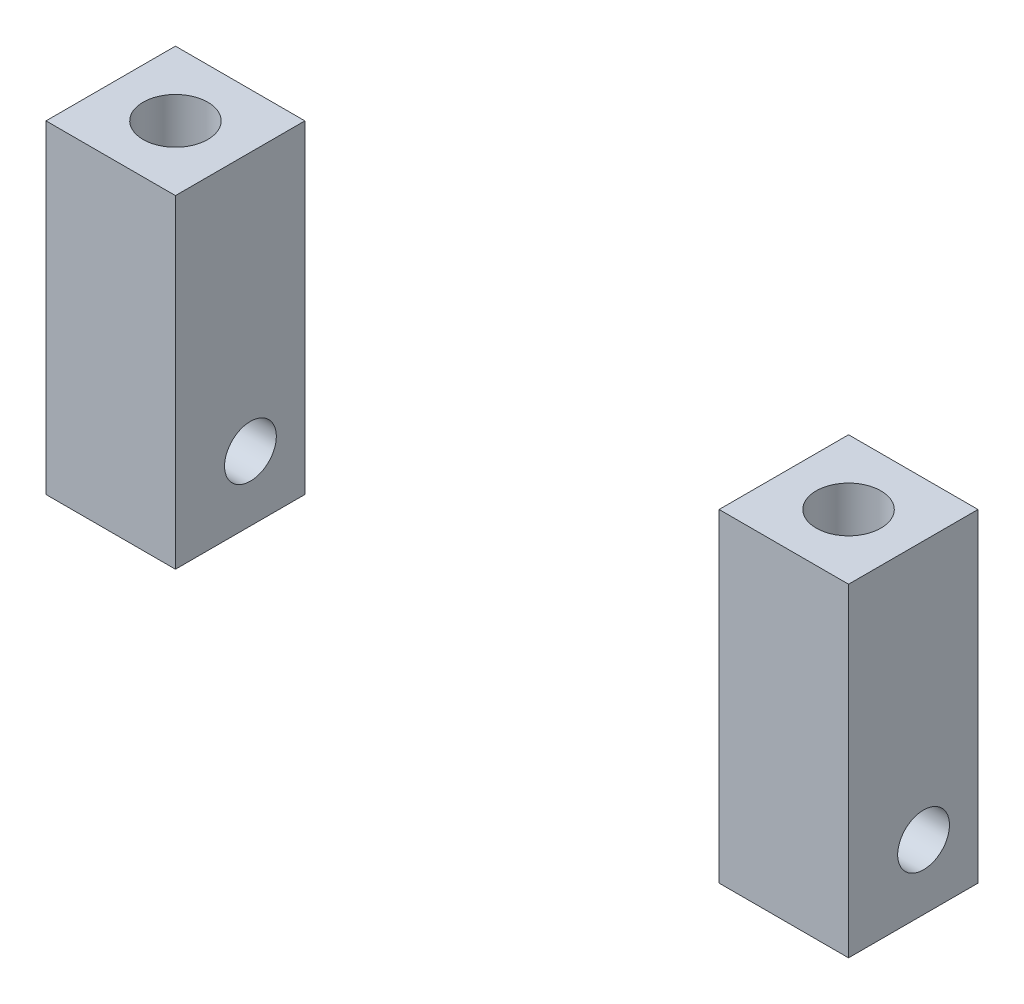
from build123d import *

# Parameters (mm, degrees)
SKIZZE1_W                         = 10
SKIZZE1_H                         = 10
AUFSATZ_LINEAR_AUSTRAGEN1_DEPTH   = 25
AUFSATZ_LINEAR_AUSTRAGEN1_2_DEPTH = 25
SKIZZE2_R                         = 2.5
SCHNITT_LINEAR_AUSTRAGEN1_DEPTH   = 15
SKIZZE3_R                         = 2
SCHNITT_LINEAR_AUSTRAGEN3_DEPTH   = 62


with BuildPart() as part:
    # Skizze1 → Aufsatz-Linear austragen1 (new body)
    with BuildSketch(Plane(origin=(0, 0, 0), x_dir=(1, 0, 0), z_dir=(0, 1, 0))):
        with Locations((8.805033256, -0.794554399)):
            Rectangle(SKIZZE1_W, SKIZZE1_H)
    extrude(amount=AUFSATZ_LINEAR_AUSTRAGEN1_DEPTH)


with BuildPart() as body_2:
    # Skizze1 → Aufsatz-Linear austragen1 2 (new body)
    with BuildSketch(Plane(origin=(0, 0, 0), x_dir=(1, 0, 0), z_dir=(0, 1, 0))):
        with Locations((-43.194966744, -0.794554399)):
            Rectangle(SKIZZE1_W, SKIZZE1_H)
    extrude(amount=AUFSATZ_LINEAR_AUSTRAGEN1_2_DEPTH)


with BuildPart() as schnitt_linear_austragen1_tool:
    # Skizze2 → Schnitt-Linear austragen1 (new body)
    with BuildSketch(Plane(origin=(0, 25, 0), x_dir=(1, 0, 0), z_dir=(0, 1, 0))):
        with Locations(Location((8.805033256, -0.794554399, 0), (0, 0, 270))):
            Circle(SKIZZE2_R)
        with Locations(Location((-43.194966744, -0.794554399, 0), (0, 0, 270))):
            Circle(SKIZZE2_R)
    extrude(amount=-SCHNITT_LINEAR_AUSTRAGEN1_DEPTH)


with BuildPart() as part_1:
    add(part.part)

    # Schnitt-Linear austragen1: cut by schnitt_linear_austragen1_tool
    add(schnitt_linear_austragen1_tool.part, mode=Mode.SUBTRACT)


with BuildPart() as body_2_1:
    add(body_2.part)

    # Schnitt-Linear austragen1: cut by schnitt_linear_austragen1_tool
    add(schnitt_linear_austragen1_tool.part, mode=Mode.SUBTRACT)


with BuildPart() as schnitt_linear_austragen3_tool:
    # Skizze3 → Schnitt-Linear austragen3 (new body)
    with BuildSketch(Plane(origin=(13.805033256, 0, 0), x_dir=(0, 0, -1), z_dir=(1, 0, 0))):
        with Locations((0, 5)):
            Circle(SKIZZE3_R)
    extrude(amount=-SCHNITT_LINEAR_AUSTRAGEN3_DEPTH)


with BuildPart() as part_2:
    add(part_1.part)

    # Schnitt-Linear austragen3: cut by schnitt_linear_austragen3_tool
    add(schnitt_linear_austragen3_tool.part, mode=Mode.SUBTRACT)


with BuildPart() as body_2_2:
    add(body_2_1.part)

    # Schnitt-Linear austragen3: cut by schnitt_linear_austragen3_tool
    add(schnitt_linear_austragen3_tool.part, mode=Mode.SUBTRACT)


solid = Compound([part_2.part, body_2_2.part])
